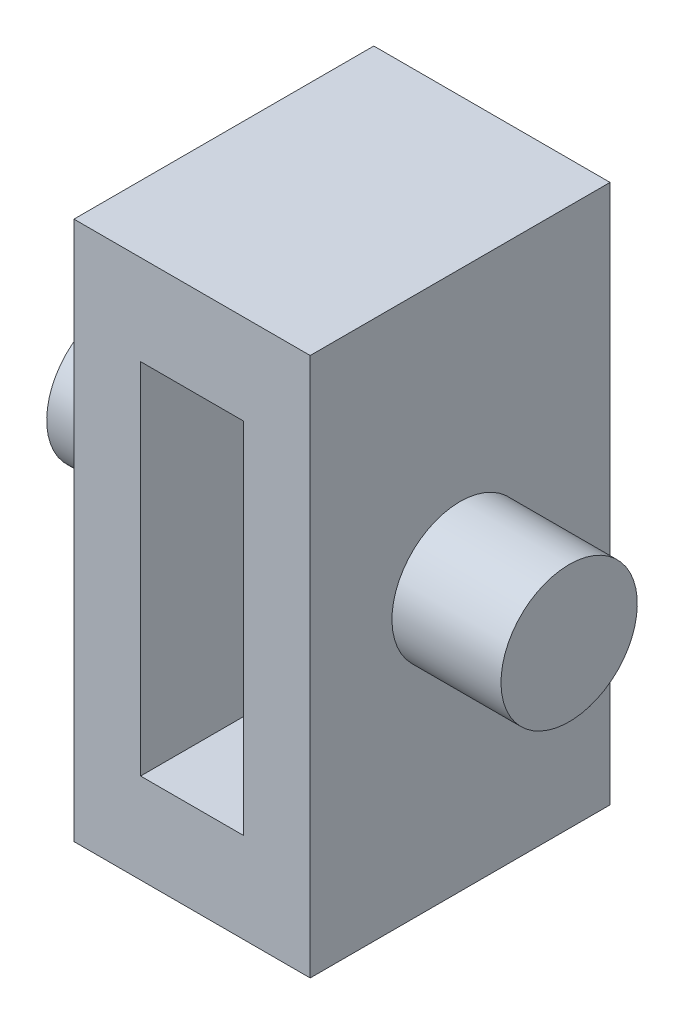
ISO-10303-21;
HEADER;
FILE_DESCRIPTION(('STEP AP214'),'2;1');
FILE_NAME('part.step','',(''),(''),'','','');
FILE_SCHEMA(('AUTOMOTIVE_DESIGN { 1 0 10303 214 1 1 1 1 }'));
ENDSEC;
DATA;
#1=APPLICATION_CONTEXT('core data for automotive mechanical design processes');
#2=APPLICATION_PROTOCOL_DEFINITION('international standard','automotive_design',2000,#1);
#3=PRODUCT_CONTEXT('',#1,'mechanical');
#4=PRODUCT('Part','Part','',(#3));
#5=PRODUCT_RELATED_PRODUCT_CATEGORY('part','',(#4));
#6=PRODUCT_DEFINITION_FORMATION('','',#4);
#7=PRODUCT_DEFINITION_CONTEXT('part definition',#1,'design');
#8=PRODUCT_DEFINITION('design','',#6,#7);
#9=PRODUCT_DEFINITION_SHAPE('','',#8);
#10=(LENGTH_UNIT() NAMED_UNIT(*) SI_UNIT(.MILLI.,.METRE.));
#11=(NAMED_UNIT(*) PLANE_ANGLE_UNIT() SI_UNIT($,.RADIAN.));
#12=(NAMED_UNIT(*) SI_UNIT($,.STERADIAN.) SOLID_ANGLE_UNIT());
#13=UNCERTAINTY_MEASURE_WITH_UNIT(LENGTH_MEASURE(1.E-05),#10,'distance_accuracy_value','');
#14=(GEOMETRIC_REPRESENTATION_CONTEXT(3) GLOBAL_UNCERTAINTY_ASSIGNED_CONTEXT((#13)) GLOBAL_UNIT_ASSIGNED_CONTEXT((#10,
#11,#12)) REPRESENTATION_CONTEXT('',''));
#15=CARTESIAN_POINT('',(0.,0.,0.));
#16=DIRECTION('',(0.,0.,1.));
#17=DIRECTION('',(1.,0.,0.));
#18=AXIS2_PLACEMENT_3D('',#15,#16,#17);
#19=CARTESIAN_POINT('',(-0.0479516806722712,17.7422268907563,9.9));
#20=DIRECTION('',(1.,0.,0.));
#21=DIRECTION('',(0.,1.,0.));
#22=AXIS2_PLACEMENT_3D('',#19,#20,#21);
#23=PLANE('',#22);
#24=CARTESIAN_POINT('',(-0.0479516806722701,8.8422268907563,4.95));
#25=DIRECTION('',(-1.,0.,0.));
#26=DIRECTION('',(0.,-1.,0.));
#27=AXIS2_PLACEMENT_3D('',#24,#25,#26);
#28=CIRCLE('',#27,2.25);
#29=CARTESIAN_POINT('',(-0.0479516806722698,6.5922268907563,4.95));
#30=VERTEX_POINT('',#29);
#31=EDGE_CURVE('E11',#30,#30,#28,.T.);
#32=ORIENTED_EDGE('',*,*,#31,.F.);
#33=EDGE_LOOP('',(#32));
#34=FACE_BOUND('',#33,.T.);
#35=DIRECTION('',(0.,-1.,0.));
#36=VECTOR('',#35,1.);
#37=CARTESIAN_POINT('',(-0.0479516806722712,17.7422268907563,0.));
#38=LINE('',#37,#36);
#39=CARTESIAN_POINT('',(-0.0479516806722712,17.7422268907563,0.));
#40=VERTEX_POINT('',#39);
#41=CARTESIAN_POINT('',(-0.047951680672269,-0.0577731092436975,0.));
#42=VERTEX_POINT('',#41);
#43=EDGE_CURVE('E158',#40,#42,#38,.T.);
#44=ORIENTED_EDGE('',*,*,#43,.T.);
#45=DIRECTION('',(0.,0.,-1.));
#46=VECTOR('',#45,1.);
#47=CARTESIAN_POINT('',(-0.047951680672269,-0.0577731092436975,9.9));
#48=LINE('',#47,#46);
#49=CARTESIAN_POINT('',(-0.047951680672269,-0.0577731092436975,9.9));
#50=VERTEX_POINT('',#49);
#51=EDGE_CURVE('E48',#50,#42,#48,.T.);
#52=ORIENTED_EDGE('',*,*,#51,.F.);
#53=DIRECTION('',(0.,-1.,0.));
#54=VECTOR('',#53,1.);
#55=CARTESIAN_POINT('',(-0.0479516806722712,17.7422268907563,9.9));
#56=LINE('',#55,#54);
#57=CARTESIAN_POINT('',(-0.0479516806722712,17.7422268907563,9.9));
#58=VERTEX_POINT('',#57);
#59=EDGE_CURVE('E164',#58,#50,#56,.T.);
#60=ORIENTED_EDGE('',*,*,#59,.F.);
#61=DIRECTION('',(0.,0.,-1.));
#62=VECTOR('',#61,1.);
#63=CARTESIAN_POINT('',(-0.0479516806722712,17.7422268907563,9.9));
#64=LINE('',#63,#62);
#65=EDGE_CURVE('E178',#58,#40,#64,.T.);
#66=ORIENTED_EDGE('',*,*,#65,.T.);
#67=EDGE_LOOP('',(#44,#52,#60,#66));
#68=FACE_BOUND('',#67,.T.);
#69=ADVANCED_FACE('F45',(#34,#68),#23,.F.);
#70=CARTESIAN_POINT('',(-0.047951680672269,-0.0577731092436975,9.9));
#71=DIRECTION('',(0.,1.,0.));
#72=DIRECTION('',(0.,0.,1.));
#73=AXIS2_PLACEMENT_3D('',#70,#71,#72);
#74=PLANE('',#73);
#75=DIRECTION('',(1.,0.,0.));
#76=VECTOR('',#75,1.);
#77=CARTESIAN_POINT('',(-0.047951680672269,-0.0577731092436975,0.));
#78=LINE('',#77,#76);
#79=CARTESIAN_POINT('',(7.75204831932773,-0.0577731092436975,0.));
#80=VERTEX_POINT('',#79);
#81=EDGE_CURVE('E182',#42,#80,#78,.T.);
#82=ORIENTED_EDGE('',*,*,#81,.T.);
#83=DIRECTION('',(0.,0.,-1.));
#84=VECTOR('',#83,1.);
#85=CARTESIAN_POINT('',(7.75204831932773,-0.0577731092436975,9.9));
#86=LINE('',#85,#84);
#87=CARTESIAN_POINT('',(7.75204831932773,-0.0577731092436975,9.9));
#88=VERTEX_POINT('',#87);
#89=EDGE_CURVE('E196',#88,#80,#86,.T.);
#90=ORIENTED_EDGE('',*,*,#89,.F.);
#91=DIRECTION('',(1.,0.,0.));
#92=VECTOR('',#91,1.);
#93=CARTESIAN_POINT('',(-0.047951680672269,-0.0577731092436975,9.9));
#94=LINE('',#93,#92);
#95=EDGE_CURVE('E168',#50,#88,#94,.T.);
#96=ORIENTED_EDGE('',*,*,#95,.F.);
#97=ORIENTED_EDGE('',*,*,#51,.T.);
#98=EDGE_LOOP('',(#82,#90,#96,#97));
#99=FACE_BOUND('',#98,.T.);
#100=ADVANCED_FACE('F216',(#99),#74,.F.);
#101=CARTESIAN_POINT('',(7.75204831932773,17.7422268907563,9.9));
#102=DIRECTION('',(-1.,0.,0.));
#103=DIRECTION('',(0.,-1.,0.));
#104=AXIS2_PLACEMENT_3D('',#101,#102,#103);
#105=PLANE('',#104);
#106=CARTESIAN_POINT('',(7.75204831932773,8.8422268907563,4.95));
#107=DIRECTION('',(1.,0.,0.));
#108=DIRECTION('',(0.,1.,0.));
#109=AXIS2_PLACEMENT_3D('',#106,#107,#108);
#110=CIRCLE('',#109,2.25);
#111=CARTESIAN_POINT('',(7.75204831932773,11.0922268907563,4.95));
#112=VERTEX_POINT('',#111);
#113=EDGE_CURVE('E54',#112,#112,#110,.T.);
#114=ORIENTED_EDGE('',*,*,#113,.F.);
#115=EDGE_LOOP('',(#114));
#116=FACE_BOUND('',#115,.T.);
#117=DIRECTION('',(0.,1.,0.));
#118=VECTOR('',#117,1.);
#119=CARTESIAN_POINT('',(7.75204831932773,17.7422268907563,0.));
#120=LINE('',#119,#118);
#121=CARTESIAN_POINT('',(7.75204831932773,17.7422268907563,0.));
#122=VERTEX_POINT('',#121);
#123=EDGE_CURVE('E185',#80,#122,#120,.T.);
#124=ORIENTED_EDGE('',*,*,#123,.T.);
#125=DIRECTION('',(0.,0.,-1.));
#126=VECTOR('',#125,1.);
#127=CARTESIAN_POINT('',(7.75204831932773,17.7422268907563,9.9));
#128=LINE('',#127,#126);
#129=CARTESIAN_POINT('',(7.75204831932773,17.7422268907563,9.9));
#130=VERTEX_POINT('',#129);
#131=EDGE_CURVE('E193',#130,#122,#128,.T.);
#132=ORIENTED_EDGE('',*,*,#131,.F.);
#133=DIRECTION('',(0.,1.,0.));
#134=VECTOR('',#133,1.);
#135=CARTESIAN_POINT('',(7.75204831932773,17.7422268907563,9.9));
#136=LINE('',#135,#134);
#137=EDGE_CURVE('E172',#88,#130,#136,.T.);
#138=ORIENTED_EDGE('',*,*,#137,.F.);
#139=ORIENTED_EDGE('',*,*,#89,.T.);
#140=EDGE_LOOP('',(#124,#132,#138,#139));
#141=FACE_BOUND('',#140,.T.);
#142=ADVANCED_FACE('F213',(#116,#141),#105,.F.);
#143=CARTESIAN_POINT('',(-0.0479516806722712,17.7422268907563,9.9));
#144=DIRECTION('',(0.,-1.,0.));
#145=DIRECTION('',(0.,0.,-1.));
#146=AXIS2_PLACEMENT_3D('',#143,#144,#145);
#147=PLANE('',#146);
#148=DIRECTION('',(-1.,0.,0.));
#149=VECTOR('',#148,1.);
#150=CARTESIAN_POINT('',(-0.0479516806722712,17.7422268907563,0.));
#151=LINE('',#150,#149);
#152=EDGE_CURVE('E169',#122,#40,#151,.T.);
#153=ORIENTED_EDGE('',*,*,#152,.T.);
#154=ORIENTED_EDGE('',*,*,#65,.F.);
#155=DIRECTION('',(-1.,0.,0.));
#156=VECTOR('',#155,1.);
#157=CARTESIAN_POINT('',(-0.0479516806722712,17.7422268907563,9.9));
#158=LINE('',#157,#156);
#159=EDGE_CURVE('E175',#130,#58,#158,.T.);
#160=ORIENTED_EDGE('',*,*,#159,.F.);
#161=ORIENTED_EDGE('',*,*,#131,.T.);
#162=EDGE_LOOP('',(#153,#154,#160,#161));
#163=FACE_BOUND('',#162,.T.);
#164=ADVANCED_FACE('F215',(#163),#147,.F.);
#165=CARTESIAN_POINT('',(0.,0.,9.9));
#166=DIRECTION('',(0.,0.,1.));
#167=DIRECTION('',(1.,0.,0.));
#168=AXIS2_PLACEMENT_3D('',#165,#166,#167);
#169=PLANE('',#168);
#170=DIRECTION('',(0.,-1.,0.));
#171=VECTOR('',#170,1.);
#172=CARTESIAN_POINT('',(2.15204831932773,14.7672268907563,9.9));
#173=LINE('',#172,#171);
#174=CARTESIAN_POINT('',(2.15204831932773,14.7672268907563,9.9));
#175=VERTEX_POINT('',#174);
#176=CARTESIAN_POINT('',(2.15204831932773,2.9172268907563,9.9));
#177=VERTEX_POINT('',#176);
#178=EDGE_CURVE('E62',#175,#177,#173,.T.);
#179=ORIENTED_EDGE('',*,*,#178,.F.);
#180=DIRECTION('',(-1.,0.,0.));
#181=VECTOR('',#180,1.);
#182=CARTESIAN_POINT('',(2.15204831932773,14.7672268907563,9.9));
#183=LINE('',#182,#181);
#184=CARTESIAN_POINT('',(5.55204831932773,14.7672268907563,9.9));
#185=VERTEX_POINT('',#184);
#186=EDGE_CURVE('E133',#185,#175,#183,.T.);
#187=ORIENTED_EDGE('',*,*,#186,.F.);
#188=DIRECTION('',(0.,1.,0.));
#189=VECTOR('',#188,1.);
#190=CARTESIAN_POINT('',(5.55204831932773,14.7672268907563,9.9));
#191=LINE('',#190,#189);
#192=CARTESIAN_POINT('',(5.55204831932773,2.9172268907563,9.9));
#193=VERTEX_POINT('',#192);
#194=EDGE_CURVE('E137',#193,#185,#191,.T.);
#195=ORIENTED_EDGE('',*,*,#194,.F.);
#196=DIRECTION('',(1.,0.,0.));
#197=VECTOR('',#196,1.);
#198=CARTESIAN_POINT('',(2.15204831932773,2.9172268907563,9.9));
#199=LINE('',#198,#197);
#200=EDGE_CURVE('E148',#177,#193,#199,.T.);
#201=ORIENTED_EDGE('',*,*,#200,.F.);
#202=EDGE_LOOP('',(#179,#187,#195,#201));
#203=FACE_BOUND('',#202,.T.);
#204=ORIENTED_EDGE('',*,*,#59,.T.);
#205=ORIENTED_EDGE('',*,*,#95,.T.);
#206=ORIENTED_EDGE('',*,*,#137,.T.);
#207=ORIENTED_EDGE('',*,*,#159,.T.);
#208=EDGE_LOOP('',(#204,#205,#206,#207));
#209=FACE_BOUND('',#208,.T.);
#210=ADVANCED_FACE('F227',(#203,#209),#169,.T.);
#211=CARTESIAN_POINT('',(0.,0.,0.));
#212=DIRECTION('',(0.,0.,1.));
#213=DIRECTION('',(1.,0.,0.));
#214=AXIS2_PLACEMENT_3D('',#211,#212,#213);
#215=PLANE('',#214);
#216=DIRECTION('',(-1.,0.,0.));
#217=VECTOR('',#216,1.);
#218=CARTESIAN_POINT('',(2.15204831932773,14.7672268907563,0.));
#219=LINE('',#218,#217);
#220=CARTESIAN_POINT('',(5.55204831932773,14.7672268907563,0.));
#221=VERTEX_POINT('',#220);
#222=CARTESIAN_POINT('',(2.15204831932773,14.7672268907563,0.));
#223=VERTEX_POINT('',#222);
#224=EDGE_CURVE('E121',#221,#223,#219,.T.);
#225=ORIENTED_EDGE('',*,*,#224,.T.);
#226=DIRECTION('',(0.,-1.,0.));
#227=VECTOR('',#226,1.);
#228=CARTESIAN_POINT('',(2.15204831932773,14.7672268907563,0.));
#229=LINE('',#228,#227);
#230=CARTESIAN_POINT('',(2.15204831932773,2.9172268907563,0.));
#231=VERTEX_POINT('',#230);
#232=EDGE_CURVE('E114',#223,#231,#229,.T.);
#233=ORIENTED_EDGE('',*,*,#232,.T.);
#234=DIRECTION('',(1.,0.,0.));
#235=VECTOR('',#234,1.);
#236=CARTESIAN_POINT('',(2.15204831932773,2.9172268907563,0.));
#237=LINE('',#236,#235);
#238=CARTESIAN_POINT('',(5.55204831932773,2.9172268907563,0.));
#239=VERTEX_POINT('',#238);
#240=EDGE_CURVE('E124',#231,#239,#237,.T.);
#241=ORIENTED_EDGE('',*,*,#240,.T.);
#242=DIRECTION('',(0.,1.,0.));
#243=VECTOR('',#242,1.);
#244=CARTESIAN_POINT('',(5.55204831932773,14.7672268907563,0.));
#245=LINE('',#244,#243);
#246=EDGE_CURVE('E70',#239,#221,#245,.T.);
#247=ORIENTED_EDGE('',*,*,#246,.T.);
#248=EDGE_LOOP('',(#225,#233,#241,#247));
#249=FACE_BOUND('',#248,.T.);
#250=ORIENTED_EDGE('',*,*,#43,.F.);
#251=ORIENTED_EDGE('',*,*,#152,.F.);
#252=ORIENTED_EDGE('',*,*,#123,.F.);
#253=ORIENTED_EDGE('',*,*,#81,.F.);
#254=EDGE_LOOP('',(#250,#251,#252,#253));
#255=FACE_BOUND('',#254,.T.);
#256=ADVANCED_FACE('F129',(#249,#255),#215,.F.);
#257=CARTESIAN_POINT('',(2.15204831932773,14.7672268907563,0.));
#258=DIRECTION('',(-1.,0.,0.));
#259=DIRECTION('',(0.,-1.,0.));
#260=AXIS2_PLACEMENT_3D('',#257,#258,#259);
#261=PLANE('',#260);
#262=ORIENTED_EDGE('',*,*,#178,.T.);
#263=DIRECTION('',(0.,0.,1.));
#264=VECTOR('',#263,1.);
#265=CARTESIAN_POINT('',(2.15204831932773,2.9172268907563,0.));
#266=LINE('',#265,#264);
#267=EDGE_CURVE('E110',#231,#177,#266,.T.);
#268=ORIENTED_EDGE('',*,*,#267,.F.);
#269=ORIENTED_EDGE('',*,*,#232,.F.);
#270=DIRECTION('',(0.,0.,1.));
#271=VECTOR('',#270,1.);
#272=CARTESIAN_POINT('',(2.15204831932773,14.7672268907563,0.));
#273=LINE('',#272,#271);
#274=EDGE_CURVE('E155',#223,#175,#273,.T.);
#275=ORIENTED_EDGE('',*,*,#274,.T.);
#276=EDGE_LOOP('',(#262,#268,#269,#275));
#277=FACE_BOUND('',#276,.T.);
#278=ADVANCED_FACE('F112',(#277),#261,.F.);
#279=CARTESIAN_POINT('',(2.15204831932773,14.7672268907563,0.));
#280=DIRECTION('',(0.,1.,0.));
#281=DIRECTION('',(0.,0.,1.));
#282=AXIS2_PLACEMENT_3D('',#279,#280,#281);
#283=PLANE('',#282);
#284=ORIENTED_EDGE('',*,*,#186,.T.);
#285=ORIENTED_EDGE('',*,*,#274,.F.);
#286=ORIENTED_EDGE('',*,*,#224,.F.);
#287=DIRECTION('',(0.,0.,1.));
#288=VECTOR('',#287,1.);
#289=CARTESIAN_POINT('',(5.55204831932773,14.7672268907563,0.));
#290=LINE('',#289,#288);
#291=EDGE_CURVE('E159',#221,#185,#290,.T.);
#292=ORIENTED_EDGE('',*,*,#291,.T.);
#293=EDGE_LOOP('',(#284,#285,#286,#292));
#294=FACE_BOUND('',#293,.T.);
#295=ADVANCED_FACE('F243',(#294),#283,.F.);
#296=CARTESIAN_POINT('',(5.55204831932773,14.7672268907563,0.));
#297=DIRECTION('',(1.,0.,0.));
#298=DIRECTION('',(0.,1.,0.));
#299=AXIS2_PLACEMENT_3D('',#296,#297,#298);
#300=PLANE('',#299);
#301=ORIENTED_EDGE('',*,*,#194,.T.);
#302=ORIENTED_EDGE('',*,*,#291,.F.);
#303=ORIENTED_EDGE('',*,*,#246,.F.);
#304=DIRECTION('',(0.,0.,1.));
#305=VECTOR('',#304,1.);
#306=CARTESIAN_POINT('',(5.55204831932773,2.9172268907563,0.));
#307=LINE('',#306,#305);
#308=EDGE_CURVE('E120',#239,#193,#307,.T.);
#309=ORIENTED_EDGE('',*,*,#308,.T.);
#310=EDGE_LOOP('',(#301,#302,#303,#309));
#311=FACE_BOUND('',#310,.T.);
#312=ADVANCED_FACE('F246',(#311),#300,.F.);
#313=CARTESIAN_POINT('',(2.15204831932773,2.9172268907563,0.));
#314=DIRECTION('',(0.,-1.,0.));
#315=DIRECTION('',(0.,0.,-1.));
#316=AXIS2_PLACEMENT_3D('',#313,#314,#315);
#317=PLANE('',#316);
#318=ORIENTED_EDGE('',*,*,#200,.T.);
#319=ORIENTED_EDGE('',*,*,#308,.F.);
#320=ORIENTED_EDGE('',*,*,#240,.F.);
#321=ORIENTED_EDGE('',*,*,#267,.T.);
#322=EDGE_LOOP('',(#318,#319,#320,#321));
#323=FACE_BOUND('',#322,.T.);
#324=ADVANCED_FACE('F125',(#323),#317,.F.);
#325=CARTESIAN_POINT('',(11.3520483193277,8.8422268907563,4.95));
#326=DIRECTION('',(-1.,0.,0.));
#327=DIRECTION('',(0.,-1.,0.));
#328=AXIS2_PLACEMENT_3D('',#325,#326,#327);
#329=CYLINDRICAL_SURFACE('',#328,2.25);
#330=CARTESIAN_POINT('',(11.3520483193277,8.8422268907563,4.95));
#331=DIRECTION('',(1.,0.,0.));
#332=DIRECTION('',(0.,1.,0.));
#333=AXIS2_PLACEMENT_3D('',#330,#331,#332);
#334=CIRCLE('',#333,2.25);
#335=CARTESIAN_POINT('',(11.3520483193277,11.0922268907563,4.95));
#336=VERTEX_POINT('',#335);
#337=EDGE_CURVE('E149',#336,#336,#334,.T.);
#338=ORIENTED_EDGE('',*,*,#337,.F.);
#339=EDGE_LOOP('',(#338));
#340=FACE_BOUND('',#339,.T.);
#341=ORIENTED_EDGE('',*,*,#113,.T.);
#342=EDGE_LOOP('',(#341));
#343=FACE_BOUND('',#342,.T.);
#344=ADVANCED_FACE('F211',(#340,#343),#329,.T.);
#345=CARTESIAN_POINT('',(11.3520483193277,8.8422268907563,4.95));
#346=DIRECTION('',(1.,0.,0.));
#347=DIRECTION('',(0.,1.,0.));
#348=AXIS2_PLACEMENT_3D('',#345,#346,#347);
#349=PLANE('',#348);
#350=ORIENTED_EDGE('',*,*,#337,.T.);
#351=EDGE_LOOP('',(#350));
#352=FACE_BOUND('',#351,.T.);
#353=ADVANCED_FACE('F254',(#352),#349,.T.);
#354=CARTESIAN_POINT('',(-3.64795168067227,8.8422268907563,4.95));
#355=DIRECTION('',(1.,0.,0.));
#356=DIRECTION('',(0.,1.,0.));
#357=AXIS2_PLACEMENT_3D('',#354,#355,#356);
#358=CYLINDRICAL_SURFACE('',#357,2.25);
#359=CARTESIAN_POINT('',(-3.64795168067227,8.8422268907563,4.95));
#360=DIRECTION('',(-1.,0.,0.));
#361=DIRECTION('',(0.,-1.,0.));
#362=AXIS2_PLACEMENT_3D('',#359,#360,#361);
#363=CIRCLE('',#362,2.25);
#364=CARTESIAN_POINT('',(-3.64795168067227,6.5922268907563,4.95));
#365=VERTEX_POINT('',#364);
#366=EDGE_CURVE('E270',#365,#365,#363,.T.);
#367=ORIENTED_EDGE('',*,*,#366,.F.);
#368=EDGE_LOOP('',(#367));
#369=FACE_BOUND('',#368,.T.);
#370=ORIENTED_EDGE('',*,*,#31,.T.);
#371=EDGE_LOOP('',(#370));
#372=FACE_BOUND('',#371,.T.);
#373=ADVANCED_FACE('F258',(#369,#372),#358,.T.);
#374=CARTESIAN_POINT('',(-3.64795168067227,8.8422268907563,4.95));
#375=DIRECTION('',(-1.,0.,0.));
#376=DIRECTION('',(0.,-1.,0.));
#377=AXIS2_PLACEMENT_3D('',#374,#375,#376);
#378=PLANE('',#377);
#379=ORIENTED_EDGE('',*,*,#366,.T.);
#380=EDGE_LOOP('',(#379));
#381=FACE_BOUND('',#380,.T.);
#382=ADVANCED_FACE('F262',(#381),#378,.T.);
#383=CLOSED_SHELL('',(#69,#100,#142,#164,#210,#256,#278,#295,#312,#324,#344,#353,#373,#382));
#384=MANIFOLD_SOLID_BREP('B2',#383);
#385=ADVANCED_BREP_SHAPE_REPRESENTATION('',(#18,#384),#14);
#386=SHAPE_DEFINITION_REPRESENTATION(#9,#385);
ENDSEC;
END-ISO-10303-21;
